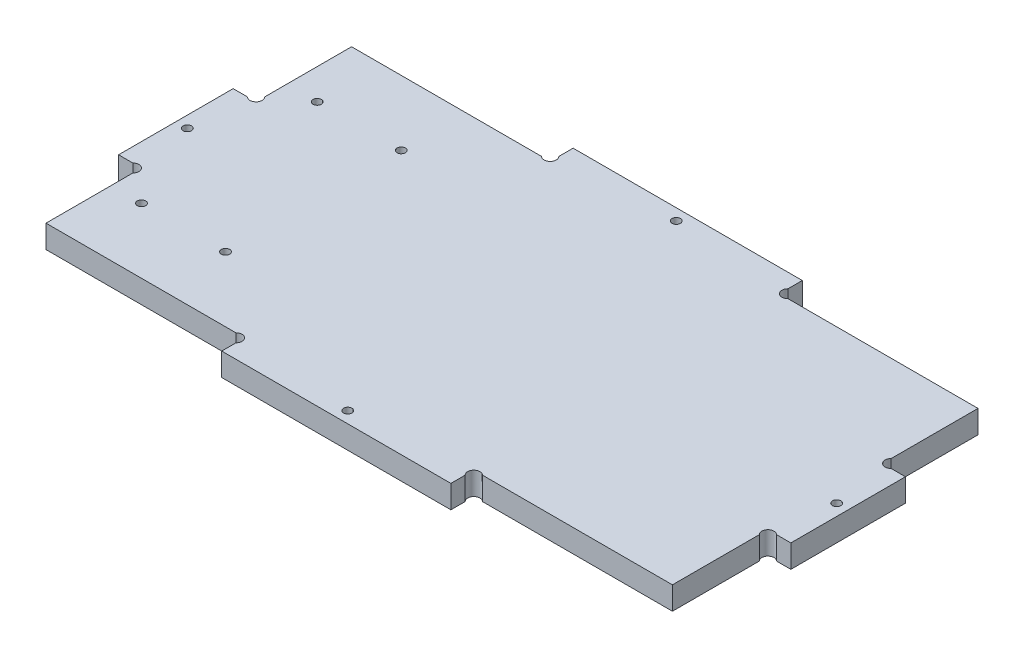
ISO-10303-21;
HEADER;
FILE_DESCRIPTION(('STEP AP214'),'2;1');
FILE_NAME('part.step','',(''),(''),'','','');
FILE_SCHEMA(('AUTOMOTIVE_DESIGN { 1 0 10303 214 1 1 1 1 }'));
ENDSEC;
DATA;
#1=APPLICATION_CONTEXT('core data for automotive mechanical design processes');
#2=APPLICATION_PROTOCOL_DEFINITION('international standard','automotive_design',2000,#1);
#3=PRODUCT_CONTEXT('',#1,'mechanical');
#4=PRODUCT('Part','Part','',(#3));
#5=PRODUCT_RELATED_PRODUCT_CATEGORY('part','',(#4));
#6=PRODUCT_DEFINITION_FORMATION('','',#4);
#7=PRODUCT_DEFINITION_CONTEXT('part definition',#1,'design');
#8=PRODUCT_DEFINITION('design','',#6,#7);
#9=PRODUCT_DEFINITION_SHAPE('','',#8);
#10=(LENGTH_UNIT() NAMED_UNIT(*) SI_UNIT(.MILLI.,.METRE.));
#11=(NAMED_UNIT(*) PLANE_ANGLE_UNIT() SI_UNIT($,.RADIAN.));
#12=(NAMED_UNIT(*) SI_UNIT($,.STERADIAN.) SOLID_ANGLE_UNIT());
#13=UNCERTAINTY_MEASURE_WITH_UNIT(LENGTH_MEASURE(1.E-05),#10,'distance_accuracy_value','');
#14=(GEOMETRIC_REPRESENTATION_CONTEXT(3) GLOBAL_UNCERTAINTY_ASSIGNED_CONTEXT((#13)) GLOBAL_UNIT_ASSIGNED_CONTEXT((#10,
#11,#12)) REPRESENTATION_CONTEXT('',''));
#15=CARTESIAN_POINT('',(0.,0.,0.));
#16=DIRECTION('',(0.,0.,1.));
#17=DIRECTION('',(1.,0.,0.));
#18=AXIS2_PLACEMENT_3D('',#15,#16,#17);
#19=CARTESIAN_POINT('',(56.8686291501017,6.,-147.131370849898));
#20=DIRECTION('',(0.,1.,0.));
#21=DIRECTION('',(0.,0.,1.));
#22=AXIS2_PLACEMENT_3D('',#19,#20,#21);
#23=PLANE('',#22);
#24=CARTESIAN_POINT('',(36.,6.,-129.));
#25=DIRECTION('',(0.,1.,0.));
#26=DIRECTION('',(0.,0.,1.));
#27=AXIS2_PLACEMENT_3D('',#24,#25,#26);
#28=CIRCLE('',#27,1.1);
#29=CARTESIAN_POINT('',(36.,6.,-127.9));
#30=VERTEX_POINT('',#29);
#31=EDGE_CURVE('E515',#30,#30,#28,.T.);
#32=ORIENTED_EDGE('',*,*,#31,.F.);
#33=EDGE_LOOP('',(#32));
#34=FACE_BOUND('',#33,.T.);
#35=CARTESIAN_POINT('',(14.,6.,-83.));
#36=DIRECTION('',(0.,1.,0.));
#37=DIRECTION('',(0.,0.,1.));
#38=AXIS2_PLACEMENT_3D('',#35,#36,#37);
#39=CIRCLE('',#38,1.1);
#40=CARTESIAN_POINT('',(14.,6.,-81.9));
#41=VERTEX_POINT('',#40);
#42=EDGE_CURVE('E527',#41,#41,#39,.T.);
#43=ORIENTED_EDGE('',*,*,#42,.F.);
#44=EDGE_LOOP('',(#43));
#45=FACE_BOUND('',#44,.T.);
#46=CARTESIAN_POINT('',(3.,6.,-106.));
#47=DIRECTION('',(0.,1.,0.));
#48=DIRECTION('',(0.,0.,1.));
#49=AXIS2_PLACEMENT_3D('',#46,#47,#48);
#50=CIRCLE('',#49,1.1);
#51=CARTESIAN_POINT('',(3.,6.,-104.9));
#52=VERTEX_POINT('',#51);
#53=EDGE_CURVE('E539',#52,#52,#50,.T.);
#54=ORIENTED_EDGE('',*,*,#53,.F.);
#55=EDGE_LOOP('',(#54));
#56=FACE_BOUND('',#55,.T.);
#57=CARTESIAN_POINT('',(88.,6.,-149.));
#58=DIRECTION('',(0.,1.,0.));
#59=DIRECTION('',(0.,0.,1.));
#60=AXIS2_PLACEMENT_3D('',#57,#58,#59);
#61=CIRCLE('',#60,1.1);
#62=CARTESIAN_POINT('',(88.,6.,-147.9));
#63=VERTEX_POINT('',#62);
#64=EDGE_CURVE('E254',#63,#63,#61,.T.);
#65=ORIENTED_EDGE('',*,*,#64,.F.);
#66=EDGE_LOOP('',(#65));
#67=FACE_BOUND('',#66,.T.);
#68=CARTESIAN_POINT('',(56.8686291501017,6.,-147.131370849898));
#69=DIRECTION('',(0.,-1.,0.));
#70=DIRECTION('',(0.,0.,1.));
#71=AXIS2_PLACEMENT_3D('',#68,#69,#70);
#72=CIRCLE('',#71,1.59999999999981);
#73=CARTESIAN_POINT('',(58.,6.,-148.262741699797));
#74=VERTEX_POINT('',#73);
#75=CARTESIAN_POINT('',(55.7372583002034,6.,-146.));
#76=VERTEX_POINT('',#75);
#77=EDGE_CURVE('E305',#74,#76,#72,.T.);
#78=ORIENTED_EDGE('',*,*,#77,.T.);
#79=DIRECTION('',(-1.,0.,0.));
#80=VECTOR('',#79,1.);
#81=CARTESIAN_POINT('',(6.,6.,-146.));
#82=LINE('',#81,#80);
#83=CARTESIAN_POINT('',(6.,6.,-146.));
#84=VERTEX_POINT('',#83);
#85=EDGE_CURVE('E153',#76,#84,#82,.T.);
#86=ORIENTED_EDGE('',*,*,#85,.T.);
#87=DIRECTION('',(0.,0.,1.));
#88=VECTOR('',#87,1.);
#89=CARTESIAN_POINT('',(6.,6.,-123.262741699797));
#90=LINE('',#89,#88);
#91=CARTESIAN_POINT('',(6.,6.,-123.262741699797));
#92=VERTEX_POINT('',#91);
#93=EDGE_CURVE('E380',#84,#92,#90,.T.);
#94=ORIENTED_EDGE('',*,*,#93,.T.);
#95=CARTESIAN_POINT('',(4.86862915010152,6.,-122.131370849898));
#96=DIRECTION('',(0.,-1.,0.));
#97=DIRECTION('',(0.,0.,1.));
#98=AXIS2_PLACEMENT_3D('',#95,#96,#97);
#99=CIRCLE('',#98,1.59999999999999);
#100=CARTESIAN_POINT('',(3.73725830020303,6.,-121.));
#101=VERTEX_POINT('',#100);
#102=EDGE_CURVE('E399',#92,#101,#99,.T.);
#103=ORIENTED_EDGE('',*,*,#102,.T.);
#104=DIRECTION('',(-1.,0.,0.));
#105=VECTOR('',#104,1.);
#106=CARTESIAN_POINT('',(3.73725830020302,6.,-121.));
#107=LINE('',#106,#105);
#108=CARTESIAN_POINT('',(0.,6.,-121.));
#109=VERTEX_POINT('',#108);
#110=EDGE_CURVE('E396',#101,#109,#107,.T.);
#111=ORIENTED_EDGE('',*,*,#110,.T.);
#112=DIRECTION('',(0.,0.,1.));
#113=VECTOR('',#112,1.);
#114=CARTESIAN_POINT('',(0.,6.,-121.));
#115=LINE('',#114,#113);
#116=CARTESIAN_POINT('',(0.,6.,-91.));
#117=VERTEX_POINT('',#116);
#118=EDGE_CURVE('E398',#109,#117,#115,.T.);
#119=ORIENTED_EDGE('',*,*,#118,.T.);
#120=DIRECTION('',(1.,0.,0.));
#121=VECTOR('',#120,1.);
#122=CARTESIAN_POINT('',(3.73725830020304,6.,-91.));
#123=LINE('',#122,#121);
#124=CARTESIAN_POINT('',(3.73725830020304,6.,-91.));
#125=VERTEX_POINT('',#124);
#126=EDGE_CURVE('E401',#117,#125,#123,.T.);
#127=ORIENTED_EDGE('',*,*,#126,.T.);
#128=CARTESIAN_POINT('',(4.86862915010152,6.,-89.8686291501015));
#129=DIRECTION('',(0.,-1.,0.));
#130=DIRECTION('',(0.,0.,-1.));
#131=AXIS2_PLACEMENT_3D('',#128,#129,#130);
#132=CIRCLE('',#131,1.59999999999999);
#133=CARTESIAN_POINT('',(6.,6.,-88.7372583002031));
#134=VERTEX_POINT('',#133);
#135=EDGE_CURVE('E407',#125,#134,#132,.T.);
#136=ORIENTED_EDGE('',*,*,#135,.T.);
#137=DIRECTION('',(0.,0.,1.));
#138=VECTOR('',#137,1.);
#139=CARTESIAN_POINT('',(6.,6.,-88.7372583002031));
#140=LINE('',#139,#138);
#141=CARTESIAN_POINT('',(6.,6.,-65.9999999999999));
#142=VERTEX_POINT('',#141);
#143=EDGE_CURVE('E409',#134,#142,#140,.T.);
#144=ORIENTED_EDGE('',*,*,#143,.T.);
#145=DIRECTION('',(1.,0.,0.));
#146=VECTOR('',#145,1.);
#147=CARTESIAN_POINT('',(6.,6.,-65.9999999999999));
#148=LINE('',#147,#146);
#149=CARTESIAN_POINT('',(55.7372583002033,6.,-66.0000000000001));
#150=VERTEX_POINT('',#149);
#151=EDGE_CURVE('E411',#142,#150,#148,.T.);
#152=ORIENTED_EDGE('',*,*,#151,.T.);
#153=CARTESIAN_POINT('',(56.8686291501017,6.,-64.8686291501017));
#154=DIRECTION('',(0.,-1.,0.));
#155=DIRECTION('',(0.,0.,-1.));
#156=AXIS2_PLACEMENT_3D('',#153,#154,#155);
#157=CIRCLE('',#156,1.59999999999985);
#158=CARTESIAN_POINT('',(58.,6.,-63.7372583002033));
#159=VERTEX_POINT('',#158);
#160=EDGE_CURVE('E413',#150,#159,#157,.T.);
#161=ORIENTED_EDGE('',*,*,#160,.T.);
#162=DIRECTION('',(0.,0.,1.));
#163=VECTOR('',#162,1.);
#164=CARTESIAN_POINT('',(58.,6.,-63.7372583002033));
#165=LINE('',#164,#163);
#166=CARTESIAN_POINT('',(58.,6.,-60.));
#167=VERTEX_POINT('',#166);
#168=EDGE_CURVE('E415',#159,#167,#165,.T.);
#169=ORIENTED_EDGE('',*,*,#168,.T.);
#170=DIRECTION('',(1.,0.,0.));
#171=VECTOR('',#170,1.);
#172=CARTESIAN_POINT('',(58.,6.,-60.));
#173=LINE('',#172,#171);
#174=CARTESIAN_POINT('',(118.,6.,-60.));
#175=VERTEX_POINT('',#174);
#176=EDGE_CURVE('E417',#167,#175,#173,.T.);
#177=ORIENTED_EDGE('',*,*,#176,.T.);
#178=DIRECTION('',(0.,0.,-1.));
#179=VECTOR('',#178,1.);
#180=CARTESIAN_POINT('',(118.,6.,-60.));
#181=LINE('',#180,#179);
#182=CARTESIAN_POINT('',(118.,6.,-63.7372583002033));
#183=VERTEX_POINT('',#182);
#184=EDGE_CURVE('E419',#175,#183,#181,.T.);
#185=ORIENTED_EDGE('',*,*,#184,.T.);
#186=CARTESIAN_POINT('',(119.131370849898,6.,-64.8686291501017));
#187=DIRECTION('',(0.,-1.,0.));
#188=DIRECTION('',(0.,0.,1.));
#189=AXIS2_PLACEMENT_3D('',#186,#187,#188);
#190=CIRCLE('',#189,1.59999999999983);
#191=CARTESIAN_POINT('',(120.262741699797,6.,-66.0000000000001));
#192=VERTEX_POINT('',#191);
#193=EDGE_CURVE('E421',#183,#192,#190,.T.);
#194=ORIENTED_EDGE('',*,*,#193,.T.);
#195=DIRECTION('',(1.,0.,0.));
#196=VECTOR('',#195,1.);
#197=CARTESIAN_POINT('',(120.262741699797,6.,-66.0000000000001));
#198=LINE('',#197,#196);
#199=CARTESIAN_POINT('',(170.,6.,-66.));
#200=VERTEX_POINT('',#199);
#201=EDGE_CURVE('E423',#192,#200,#198,.T.);
#202=ORIENTED_EDGE('',*,*,#201,.T.);
#203=DIRECTION('',(0.,0.,-1.));
#204=VECTOR('',#203,1.);
#205=CARTESIAN_POINT('',(170.,6.,-88.7372583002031));
#206=LINE('',#205,#204);
#207=CARTESIAN_POINT('',(170.,6.,-88.7372583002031));
#208=VERTEX_POINT('',#207);
#209=EDGE_CURVE('E425',#200,#208,#206,.T.);
#210=ORIENTED_EDGE('',*,*,#209,.T.);
#211=CARTESIAN_POINT('',(171.131370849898,6.,-89.8686291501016));
#212=DIRECTION('',(0.,-1.,0.));
#213=DIRECTION('',(0.,0.,1.));
#214=AXIS2_PLACEMENT_3D('',#211,#212,#213);
#215=CIRCLE('',#214,1.59999999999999);
#216=CARTESIAN_POINT('',(172.262741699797,6.,-91.));
#217=VERTEX_POINT('',#216);
#218=EDGE_CURVE('E427',#208,#217,#215,.T.);
#219=ORIENTED_EDGE('',*,*,#218,.T.);
#220=DIRECTION('',(1.,0.,0.));
#221=VECTOR('',#220,1.);
#222=CARTESIAN_POINT('',(172.262741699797,6.,-91.));
#223=LINE('',#222,#221);
#224=CARTESIAN_POINT('',(176.,6.,-91.));
#225=VERTEX_POINT('',#224);
#226=EDGE_CURVE('E429',#217,#225,#223,.T.);
#227=ORIENTED_EDGE('',*,*,#226,.T.);
#228=DIRECTION('',(0.,0.,-1.));
#229=VECTOR('',#228,1.);
#230=CARTESIAN_POINT('',(176.,6.,-121.));
#231=LINE('',#230,#229);
#232=CARTESIAN_POINT('',(176.,6.,-121.));
#233=VERTEX_POINT('',#232);
#234=EDGE_CURVE('E431',#225,#233,#231,.T.);
#235=ORIENTED_EDGE('',*,*,#234,.T.);
#236=DIRECTION('',(-1.,0.,0.));
#237=VECTOR('',#236,1.);
#238=CARTESIAN_POINT('',(172.262741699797,6.,-121.));
#239=LINE('',#238,#237);
#240=CARTESIAN_POINT('',(172.262741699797,6.,-121.));
#241=VERTEX_POINT('',#240);
#242=EDGE_CURVE('E433',#233,#241,#239,.T.);
#243=ORIENTED_EDGE('',*,*,#242,.T.);
#244=CARTESIAN_POINT('',(171.131370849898,6.,-122.131370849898));
#245=DIRECTION('',(0.,-1.,0.));
#246=DIRECTION('',(0.,0.,-1.));
#247=AXIS2_PLACEMENT_3D('',#244,#245,#246);
#248=CIRCLE('',#247,1.59999999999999);
#249=CARTESIAN_POINT('',(170.,6.,-123.262741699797));
#250=VERTEX_POINT('',#249);
#251=EDGE_CURVE('E435',#241,#250,#248,.T.);
#252=ORIENTED_EDGE('',*,*,#251,.T.);
#253=DIRECTION('',(0.,0.,-1.));
#254=VECTOR('',#253,1.);
#255=CARTESIAN_POINT('',(170.,6.,-123.262741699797));
#256=LINE('',#255,#254);
#257=CARTESIAN_POINT('',(170.,6.,-146.));
#258=VERTEX_POINT('',#257);
#259=EDGE_CURVE('E437',#250,#258,#256,.T.);
#260=ORIENTED_EDGE('',*,*,#259,.T.);
#261=DIRECTION('',(-1.,0.,0.));
#262=VECTOR('',#261,1.);
#263=CARTESIAN_POINT('',(120.262741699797,6.,-146.));
#264=LINE('',#263,#262);
#265=CARTESIAN_POINT('',(120.262741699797,6.,-146.));
#266=VERTEX_POINT('',#265);
#267=EDGE_CURVE('E439',#258,#266,#264,.T.);
#268=ORIENTED_EDGE('',*,*,#267,.T.);
#269=CARTESIAN_POINT('',(119.131370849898,6.,-147.131370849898));
#270=DIRECTION('',(0.,-1.,0.));
#271=DIRECTION('',(0.,0.,-1.));
#272=AXIS2_PLACEMENT_3D('',#269,#270,#271);
#273=CIRCLE('',#272,1.59999999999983);
#274=CARTESIAN_POINT('',(118.,6.,-148.262741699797));
#275=VERTEX_POINT('',#274);
#276=EDGE_CURVE('E232',#266,#275,#273,.T.);
#277=ORIENTED_EDGE('',*,*,#276,.T.);
#278=DIRECTION('',(0.,0.,-1.));
#279=VECTOR('',#278,1.);
#280=CARTESIAN_POINT('',(118.,6.,-152.));
#281=LINE('',#280,#279);
#282=CARTESIAN_POINT('',(118.,6.,-152.));
#283=VERTEX_POINT('',#282);
#284=EDGE_CURVE('E226',#275,#283,#281,.T.);
#285=ORIENTED_EDGE('',*,*,#284,.T.);
#286=DIRECTION('',(-1.,0.,0.));
#287=VECTOR('',#286,1.);
#288=CARTESIAN_POINT('',(58.,6.,-152.));
#289=LINE('',#288,#287);
#290=CARTESIAN_POINT('',(58.,6.,-152.));
#291=VERTEX_POINT('',#290);
#292=EDGE_CURVE('E230',#283,#291,#289,.T.);
#293=ORIENTED_EDGE('',*,*,#292,.T.);
#294=DIRECTION('',(0.,0.,1.));
#295=VECTOR('',#294,1.);
#296=CARTESIAN_POINT('',(58.,6.,-148.262741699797));
#297=LINE('',#296,#295);
#298=EDGE_CURVE('E50',#291,#74,#297,.T.);
#299=ORIENTED_EDGE('',*,*,#298,.T.);
#300=EDGE_LOOP('',(#78,#86,#94,#103,#111,#119,#127,#136,#144,#152,#161,#169,#177,#185,#194,#202,
#210,#219,#227,#235,#243,#252,#260,#268,#277,#285,#293,#299));
#301=FACE_BOUND('',#300,.T.);
#302=CARTESIAN_POINT('',(88.,6.,-63.));
#303=DIRECTION('',(0.,1.,0.));
#304=DIRECTION('',(0.,0.,-1.));
#305=AXIS2_PLACEMENT_3D('',#302,#303,#304);
#306=CIRCLE('',#305,1.1);
#307=CARTESIAN_POINT('',(88.,6.,-64.1));
#308=VERTEX_POINT('',#307);
#309=EDGE_CURVE('E545',#308,#308,#306,.T.);
#310=ORIENTED_EDGE('',*,*,#309,.F.);
#311=EDGE_LOOP('',(#310));
#312=FACE_BOUND('',#311,.T.);
#313=CARTESIAN_POINT('',(173.,6.,-106.));
#314=DIRECTION('',(0.,1.,0.));
#315=DIRECTION('',(0.,0.,-1.));
#316=AXIS2_PLACEMENT_3D('',#313,#314,#315);
#317=CIRCLE('',#316,1.09999999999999);
#318=CARTESIAN_POINT('',(173.,6.,-107.1));
#319=VERTEX_POINT('',#318);
#320=EDGE_CURVE('E533',#319,#319,#317,.T.);
#321=ORIENTED_EDGE('',*,*,#320,.F.);
#322=EDGE_LOOP('',(#321));
#323=FACE_BOUND('',#322,.T.);
#324=CARTESIAN_POINT('',(14.,6.,-129.));
#325=DIRECTION('',(0.,1.,0.));
#326=DIRECTION('',(0.,0.,-1.));
#327=AXIS2_PLACEMENT_3D('',#324,#325,#326);
#328=CIRCLE('',#327,1.1);
#329=CARTESIAN_POINT('',(14.,6.,-130.1));
#330=VERTEX_POINT('',#329);
#331=EDGE_CURVE('E521',#330,#330,#328,.T.);
#332=ORIENTED_EDGE('',*,*,#331,.F.);
#333=EDGE_LOOP('',(#332));
#334=FACE_BOUND('',#333,.T.);
#335=CARTESIAN_POINT('',(36.,6.,-83.));
#336=DIRECTION('',(0.,1.,0.));
#337=DIRECTION('',(0.,0.,-1.));
#338=AXIS2_PLACEMENT_3D('',#335,#336,#337);
#339=CIRCLE('',#338,1.10000000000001);
#340=CARTESIAN_POINT('',(36.,6.,-84.1));
#341=VERTEX_POINT('',#340);
#342=EDGE_CURVE('E506',#341,#341,#339,.T.);
#343=ORIENTED_EDGE('',*,*,#342,.F.);
#344=EDGE_LOOP('',(#343));
#345=FACE_BOUND('',#344,.T.);
#346=ADVANCED_FACE('F33',(#34,#45,#56,#67,#301,#312,#323,#334,#345),#23,.T.);
#347=CARTESIAN_POINT('',(56.8686291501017,0.,-147.131370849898));
#348=DIRECTION('',(0.,1.,0.));
#349=DIRECTION('',(0.,0.,1.));
#350=AXIS2_PLACEMENT_3D('',#347,#348,#349);
#351=PLANE('',#350);
#352=CARTESIAN_POINT('',(56.8686291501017,0.,-147.131370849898));
#353=DIRECTION('',(0.,-1.,0.));
#354=DIRECTION('',(0.,0.,1.));
#355=AXIS2_PLACEMENT_3D('',#352,#353,#354);
#356=CIRCLE('',#355,1.59999999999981);
#357=CARTESIAN_POINT('',(58.,0.,-148.262741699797));
#358=VERTEX_POINT('',#357);
#359=CARTESIAN_POINT('',(55.7372583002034,0.,-146.));
#360=VERTEX_POINT('',#359);
#361=EDGE_CURVE('E250',#358,#360,#356,.T.);
#362=ORIENTED_EDGE('',*,*,#361,.F.);
#363=DIRECTION('',(0.,0.,1.));
#364=VECTOR('',#363,1.);
#365=CARTESIAN_POINT('',(58.,0.,-148.262741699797));
#366=LINE('',#365,#364);
#367=CARTESIAN_POINT('',(58.,0.,-152.));
#368=VERTEX_POINT('',#367);
#369=EDGE_CURVE('E145',#368,#358,#366,.T.);
#370=ORIENTED_EDGE('',*,*,#369,.F.);
#371=DIRECTION('',(-1.,0.,0.));
#372=VECTOR('',#371,1.);
#373=CARTESIAN_POINT('',(58.,0.,-152.));
#374=LINE('',#373,#372);
#375=CARTESIAN_POINT('',(118.,0.,-152.));
#376=VERTEX_POINT('',#375);
#377=EDGE_CURVE('E139',#376,#368,#374,.T.);
#378=ORIENTED_EDGE('',*,*,#377,.F.);
#379=DIRECTION('',(0.,0.,-1.));
#380=VECTOR('',#379,1.);
#381=CARTESIAN_POINT('',(118.,0.,-152.));
#382=LINE('',#381,#380);
#383=CARTESIAN_POINT('',(118.,0.,-148.262741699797));
#384=VERTEX_POINT('',#383);
#385=EDGE_CURVE('E240',#384,#376,#382,.T.);
#386=ORIENTED_EDGE('',*,*,#385,.F.);
#387=CARTESIAN_POINT('',(119.131370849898,0.,-147.131370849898));
#388=DIRECTION('',(0.,-1.,0.));
#389=DIRECTION('',(0.,0.,-1.));
#390=AXIS2_PLACEMENT_3D('',#387,#388,#389);
#391=CIRCLE('',#390,1.59999999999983);
#392=CARTESIAN_POINT('',(120.262741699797,0.,-146.));
#393=VERTEX_POINT('',#392);
#394=EDGE_CURVE('E300',#393,#384,#391,.T.);
#395=ORIENTED_EDGE('',*,*,#394,.F.);
#396=DIRECTION('',(-1.,0.,0.));
#397=VECTOR('',#396,1.);
#398=CARTESIAN_POINT('',(120.262741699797,0.,-146.));
#399=LINE('',#398,#397);
#400=CARTESIAN_POINT('',(170.,0.,-146.));
#401=VERTEX_POINT('',#400);
#402=EDGE_CURVE('E298',#401,#393,#399,.T.);
#403=ORIENTED_EDGE('',*,*,#402,.F.);
#404=DIRECTION('',(0.,0.,-1.));
#405=VECTOR('',#404,1.);
#406=CARTESIAN_POINT('',(170.,0.,-123.262741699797));
#407=LINE('',#406,#405);
#408=CARTESIAN_POINT('',(170.,0.,-123.262741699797));
#409=VERTEX_POINT('',#408);
#410=EDGE_CURVE('E296',#409,#401,#407,.T.);
#411=ORIENTED_EDGE('',*,*,#410,.F.);
#412=CARTESIAN_POINT('',(171.131370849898,0.,-122.131370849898));
#413=DIRECTION('',(0.,-1.,0.));
#414=DIRECTION('',(0.,0.,-1.));
#415=AXIS2_PLACEMENT_3D('',#412,#413,#414);
#416=CIRCLE('',#415,1.59999999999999);
#417=CARTESIAN_POINT('',(172.262741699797,0.,-121.));
#418=VERTEX_POINT('',#417);
#419=EDGE_CURVE('E294',#418,#409,#416,.T.);
#420=ORIENTED_EDGE('',*,*,#419,.F.);
#421=DIRECTION('',(-1.,0.,0.));
#422=VECTOR('',#421,1.);
#423=CARTESIAN_POINT('',(172.262741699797,0.,-121.));
#424=LINE('',#423,#422);
#425=CARTESIAN_POINT('',(176.,0.,-121.));
#426=VERTEX_POINT('',#425);
#427=EDGE_CURVE('E292',#426,#418,#424,.T.);
#428=ORIENTED_EDGE('',*,*,#427,.F.);
#429=DIRECTION('',(0.,0.,-1.));
#430=VECTOR('',#429,1.);
#431=CARTESIAN_POINT('',(176.,0.,-121.));
#432=LINE('',#431,#430);
#433=CARTESIAN_POINT('',(176.,0.,-91.));
#434=VERTEX_POINT('',#433);
#435=EDGE_CURVE('E290',#434,#426,#432,.T.);
#436=ORIENTED_EDGE('',*,*,#435,.F.);
#437=DIRECTION('',(1.,0.,0.));
#438=VECTOR('',#437,1.);
#439=CARTESIAN_POINT('',(172.262741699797,0.,-91.));
#440=LINE('',#439,#438);
#441=CARTESIAN_POINT('',(172.262741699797,0.,-91.));
#442=VERTEX_POINT('',#441);
#443=EDGE_CURVE('E288',#442,#434,#440,.T.);
#444=ORIENTED_EDGE('',*,*,#443,.F.);
#445=CARTESIAN_POINT('',(171.131370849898,0.,-89.8686291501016));
#446=DIRECTION('',(0.,-1.,0.));
#447=DIRECTION('',(0.,0.,1.));
#448=AXIS2_PLACEMENT_3D('',#445,#446,#447);
#449=CIRCLE('',#448,1.59999999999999);
#450=CARTESIAN_POINT('',(170.,0.,-88.7372583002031));
#451=VERTEX_POINT('',#450);
#452=EDGE_CURVE('E286',#451,#442,#449,.T.);
#453=ORIENTED_EDGE('',*,*,#452,.F.);
#454=DIRECTION('',(0.,0.,-1.));
#455=VECTOR('',#454,1.);
#456=CARTESIAN_POINT('',(170.,0.,-88.7372583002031));
#457=LINE('',#456,#455);
#458=CARTESIAN_POINT('',(170.,0.,-66.));
#459=VERTEX_POINT('',#458);
#460=EDGE_CURVE('E284',#459,#451,#457,.T.);
#461=ORIENTED_EDGE('',*,*,#460,.F.);
#462=DIRECTION('',(1.,0.,0.));
#463=VECTOR('',#462,1.);
#464=CARTESIAN_POINT('',(120.262741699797,0.,-66.0000000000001));
#465=LINE('',#464,#463);
#466=CARTESIAN_POINT('',(120.262741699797,0.,-66.0000000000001));
#467=VERTEX_POINT('',#466);
#468=EDGE_CURVE('E282',#467,#459,#465,.T.);
#469=ORIENTED_EDGE('',*,*,#468,.F.);
#470=CARTESIAN_POINT('',(119.131370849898,0.,-64.8686291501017));
#471=DIRECTION('',(0.,-1.,0.));
#472=DIRECTION('',(0.,0.,1.));
#473=AXIS2_PLACEMENT_3D('',#470,#471,#472);
#474=CIRCLE('',#473,1.59999999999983);
#475=CARTESIAN_POINT('',(118.,0.,-63.7372583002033));
#476=VERTEX_POINT('',#475);
#477=EDGE_CURVE('E280',#476,#467,#474,.T.);
#478=ORIENTED_EDGE('',*,*,#477,.F.);
#479=DIRECTION('',(0.,0.,-1.));
#480=VECTOR('',#479,1.);
#481=CARTESIAN_POINT('',(118.,0.,-60.));
#482=LINE('',#481,#480);
#483=CARTESIAN_POINT('',(118.,0.,-60.));
#484=VERTEX_POINT('',#483);
#485=EDGE_CURVE('E278',#484,#476,#482,.T.);
#486=ORIENTED_EDGE('',*,*,#485,.F.);
#487=DIRECTION('',(1.,0.,0.));
#488=VECTOR('',#487,1.);
#489=CARTESIAN_POINT('',(58.,0.,-60.));
#490=LINE('',#489,#488);
#491=CARTESIAN_POINT('',(58.,0.,-60.));
#492=VERTEX_POINT('',#491);
#493=EDGE_CURVE('E276',#492,#484,#490,.T.);
#494=ORIENTED_EDGE('',*,*,#493,.F.);
#495=DIRECTION('',(0.,0.,1.));
#496=VECTOR('',#495,1.);
#497=CARTESIAN_POINT('',(58.,0.,-63.7372583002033));
#498=LINE('',#497,#496);
#499=CARTESIAN_POINT('',(58.,0.,-63.7372583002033));
#500=VERTEX_POINT('',#499);
#501=EDGE_CURVE('E274',#500,#492,#498,.T.);
#502=ORIENTED_EDGE('',*,*,#501,.F.);
#503=CARTESIAN_POINT('',(56.8686291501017,0.,-64.8686291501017));
#504=DIRECTION('',(0.,-1.,0.));
#505=DIRECTION('',(0.,0.,-1.));
#506=AXIS2_PLACEMENT_3D('',#503,#504,#505);
#507=CIRCLE('',#506,1.59999999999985);
#508=CARTESIAN_POINT('',(55.7372583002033,0.,-66.0000000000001));
#509=VERTEX_POINT('',#508);
#510=EDGE_CURVE('E272',#509,#500,#507,.T.);
#511=ORIENTED_EDGE('',*,*,#510,.F.);
#512=DIRECTION('',(1.,0.,0.));
#513=VECTOR('',#512,1.);
#514=CARTESIAN_POINT('',(6.,0.,-65.9999999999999));
#515=LINE('',#514,#513);
#516=CARTESIAN_POINT('',(6.,0.,-65.9999999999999));
#517=VERTEX_POINT('',#516);
#518=EDGE_CURVE('E270',#517,#509,#515,.T.);
#519=ORIENTED_EDGE('',*,*,#518,.F.);
#520=DIRECTION('',(0.,0.,1.));
#521=VECTOR('',#520,1.);
#522=CARTESIAN_POINT('',(6.,0.,-88.7372583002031));
#523=LINE('',#522,#521);
#524=CARTESIAN_POINT('',(6.,0.,-88.7372583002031));
#525=VERTEX_POINT('',#524);
#526=EDGE_CURVE('E268',#525,#517,#523,.T.);
#527=ORIENTED_EDGE('',*,*,#526,.F.);
#528=CARTESIAN_POINT('',(4.86862915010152,0.,-89.8686291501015));
#529=DIRECTION('',(0.,-1.,0.));
#530=DIRECTION('',(0.,0.,-1.));
#531=AXIS2_PLACEMENT_3D('',#528,#529,#530);
#532=CIRCLE('',#531,1.59999999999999);
#533=CARTESIAN_POINT('',(3.73725830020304,0.,-91.));
#534=VERTEX_POINT('',#533);
#535=EDGE_CURVE('E266',#534,#525,#532,.T.);
#536=ORIENTED_EDGE('',*,*,#535,.F.);
#537=DIRECTION('',(1.,0.,0.));
#538=VECTOR('',#537,1.);
#539=CARTESIAN_POINT('',(3.73725830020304,0.,-91.));
#540=LINE('',#539,#538);
#541=CARTESIAN_POINT('',(0.,0.,-91.));
#542=VERTEX_POINT('',#541);
#543=EDGE_CURVE('E264',#542,#534,#540,.T.);
#544=ORIENTED_EDGE('',*,*,#543,.F.);
#545=DIRECTION('',(0.,0.,1.));
#546=VECTOR('',#545,1.);
#547=CARTESIAN_POINT('',(0.,0.,-121.));
#548=LINE('',#547,#546);
#549=CARTESIAN_POINT('',(0.,0.,-121.));
#550=VERTEX_POINT('',#549);
#551=EDGE_CURVE('E262',#550,#542,#548,.T.);
#552=ORIENTED_EDGE('',*,*,#551,.F.);
#553=DIRECTION('',(-1.,0.,0.));
#554=VECTOR('',#553,1.);
#555=CARTESIAN_POINT('',(3.73725830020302,0.,-121.));
#556=LINE('',#555,#554);
#557=CARTESIAN_POINT('',(3.73725830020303,0.,-121.));
#558=VERTEX_POINT('',#557);
#559=EDGE_CURVE('E260',#558,#550,#556,.T.);
#560=ORIENTED_EDGE('',*,*,#559,.F.);
#561=CARTESIAN_POINT('',(4.86862915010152,0.,-122.131370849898));
#562=DIRECTION('',(0.,-1.,0.));
#563=DIRECTION('',(0.,0.,1.));
#564=AXIS2_PLACEMENT_3D('',#561,#562,#563);
#565=CIRCLE('',#564,1.59999999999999);
#566=CARTESIAN_POINT('',(6.,0.,-123.262741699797));
#567=VERTEX_POINT('',#566);
#568=EDGE_CURVE('E258',#567,#558,#565,.T.);
#569=ORIENTED_EDGE('',*,*,#568,.F.);
#570=DIRECTION('',(0.,0.,1.));
#571=VECTOR('',#570,1.);
#572=CARTESIAN_POINT('',(6.,0.,-123.262741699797));
#573=LINE('',#572,#571);
#574=CARTESIAN_POINT('',(6.,0.,-146.));
#575=VERTEX_POINT('',#574);
#576=EDGE_CURVE('E256',#575,#567,#573,.T.);
#577=ORIENTED_EDGE('',*,*,#576,.F.);
#578=DIRECTION('',(-1.,0.,0.));
#579=VECTOR('',#578,1.);
#580=CARTESIAN_POINT('',(6.,0.,-146.));
#581=LINE('',#580,#579);
#582=EDGE_CURVE('E253',#360,#575,#581,.T.);
#583=ORIENTED_EDGE('',*,*,#582,.F.);
#584=EDGE_LOOP('',(#362,#370,#378,#386,#395,#403,#411,#420,#428,#436,#444,#453,#461,#469,#478,
#486,#494,#502,#511,#519,#527,#536,#544,#552,#560,#569,#577,#583));
#585=FACE_BOUND('',#584,.T.);
#586=CARTESIAN_POINT('',(88.,0.,-149.));
#587=DIRECTION('',(0.,1.,0.));
#588=DIRECTION('',(0.,0.,1.));
#589=AXIS2_PLACEMENT_3D('',#586,#587,#588);
#590=CIRCLE('',#589,1.1);
#591=CARTESIAN_POINT('',(88.,0.,-147.9));
#592=VERTEX_POINT('',#591);
#593=EDGE_CURVE('E548',#592,#592,#590,.T.);
#594=ORIENTED_EDGE('',*,*,#593,.T.);
#595=EDGE_LOOP('',(#594));
#596=FACE_BOUND('',#595,.T.);
#597=CARTESIAN_POINT('',(88.,0.,-63.));
#598=DIRECTION('',(0.,1.,0.));
#599=DIRECTION('',(0.,0.,-1.));
#600=AXIS2_PLACEMENT_3D('',#597,#598,#599);
#601=CIRCLE('',#600,1.1);
#602=CARTESIAN_POINT('',(88.,0.,-64.1));
#603=VERTEX_POINT('',#602);
#604=EDGE_CURVE('E542',#603,#603,#601,.T.);
#605=ORIENTED_EDGE('',*,*,#604,.T.);
#606=EDGE_LOOP('',(#605));
#607=FACE_BOUND('',#606,.T.);
#608=CARTESIAN_POINT('',(3.,0.,-106.));
#609=DIRECTION('',(0.,1.,0.));
#610=DIRECTION('',(0.,0.,1.));
#611=AXIS2_PLACEMENT_3D('',#608,#609,#610);
#612=CIRCLE('',#611,1.1);
#613=CARTESIAN_POINT('',(3.,0.,-104.9));
#614=VERTEX_POINT('',#613);
#615=EDGE_CURVE('E536',#614,#614,#612,.T.);
#616=ORIENTED_EDGE('',*,*,#615,.T.);
#617=EDGE_LOOP('',(#616));
#618=FACE_BOUND('',#617,.T.);
#619=CARTESIAN_POINT('',(173.,0.,-106.));
#620=DIRECTION('',(0.,1.,0.));
#621=DIRECTION('',(0.,0.,-1.));
#622=AXIS2_PLACEMENT_3D('',#619,#620,#621);
#623=CIRCLE('',#622,1.09999999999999);
#624=CARTESIAN_POINT('',(173.,0.,-107.1));
#625=VERTEX_POINT('',#624);
#626=EDGE_CURVE('E530',#625,#625,#623,.T.);
#627=ORIENTED_EDGE('',*,*,#626,.T.);
#628=EDGE_LOOP('',(#627));
#629=FACE_BOUND('',#628,.T.);
#630=CARTESIAN_POINT('',(14.,0.,-83.));
#631=DIRECTION('',(0.,1.,0.));
#632=DIRECTION('',(0.,0.,1.));
#633=AXIS2_PLACEMENT_3D('',#630,#631,#632);
#634=CIRCLE('',#633,1.1);
#635=CARTESIAN_POINT('',(14.,0.,-81.9));
#636=VERTEX_POINT('',#635);
#637=EDGE_CURVE('E524',#636,#636,#634,.T.);
#638=ORIENTED_EDGE('',*,*,#637,.T.);
#639=EDGE_LOOP('',(#638));
#640=FACE_BOUND('',#639,.T.);
#641=CARTESIAN_POINT('',(14.,0.,-129.));
#642=DIRECTION('',(0.,1.,0.));
#643=DIRECTION('',(0.,0.,-1.));
#644=AXIS2_PLACEMENT_3D('',#641,#642,#643);
#645=CIRCLE('',#644,1.1);
#646=CARTESIAN_POINT('',(14.,0.,-130.1));
#647=VERTEX_POINT('',#646);
#648=EDGE_CURVE('E518',#647,#647,#645,.T.);
#649=ORIENTED_EDGE('',*,*,#648,.T.);
#650=EDGE_LOOP('',(#649));
#651=FACE_BOUND('',#650,.T.);
#652=CARTESIAN_POINT('',(36.,0.,-129.));
#653=DIRECTION('',(0.,1.,0.));
#654=DIRECTION('',(0.,0.,1.));
#655=AXIS2_PLACEMENT_3D('',#652,#653,#654);
#656=CIRCLE('',#655,1.1);
#657=CARTESIAN_POINT('',(36.,0.,-127.9));
#658=VERTEX_POINT('',#657);
#659=EDGE_CURVE('E512',#658,#658,#656,.T.);
#660=ORIENTED_EDGE('',*,*,#659,.T.);
#661=EDGE_LOOP('',(#660));
#662=FACE_BOUND('',#661,.T.);
#663=CARTESIAN_POINT('',(36.,0.,-83.));
#664=DIRECTION('',(0.,1.,0.));
#665=DIRECTION('',(0.,0.,-1.));
#666=AXIS2_PLACEMENT_3D('',#663,#664,#665);
#667=CIRCLE('',#666,1.10000000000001);
#668=CARTESIAN_POINT('',(36.,0.,-84.1));
#669=VERTEX_POINT('',#668);
#670=EDGE_CURVE('E509',#669,#669,#667,.T.);
#671=ORIENTED_EDGE('',*,*,#670,.T.);
#672=EDGE_LOOP('',(#671));
#673=FACE_BOUND('',#672,.T.);
#674=ADVANCED_FACE('F384',(#585,#596,#607,#618,#629,#640,#651,#662,#673),#351,.F.);
#675=CARTESIAN_POINT('',(56.8686291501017,6.,-147.131370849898));
#676=DIRECTION('',(0.,-1.,0.));
#677=DIRECTION('',(0.,0.,-1.));
#678=AXIS2_PLACEMENT_3D('',#675,#676,#677);
#679=CYLINDRICAL_SURFACE('',#678,1.59999999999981);
#680=ORIENTED_EDGE('',*,*,#361,.T.);
#681=DIRECTION('',(0.,-1.,0.));
#682=VECTOR('',#681,1.);
#683=CARTESIAN_POINT('',(55.7372583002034,6.,-146.));
#684=LINE('',#683,#682);
#685=EDGE_CURVE('E11',#76,#360,#684,.T.);
#686=ORIENTED_EDGE('',*,*,#685,.F.);
#687=ORIENTED_EDGE('',*,*,#77,.F.);
#688=DIRECTION('',(0.,-1.,0.));
#689=VECTOR('',#688,1.);
#690=CARTESIAN_POINT('',(58.,6.,-148.262741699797));
#691=LINE('',#690,#689);
#692=EDGE_CURVE('E246',#74,#358,#691,.T.);
#693=ORIENTED_EDGE('',*,*,#692,.T.);
#694=EDGE_LOOP('',(#680,#686,#687,#693));
#695=FACE_BOUND('',#694,.T.);
#696=ADVANCED_FACE('F35',(#695),#679,.F.);
#697=CARTESIAN_POINT('',(6.,6.,-146.));
#698=DIRECTION('',(0.,0.,1.));
#699=DIRECTION('',(1.,0.,0.));
#700=AXIS2_PLACEMENT_3D('',#697,#698,#699);
#701=PLANE('',#700);
#702=ORIENTED_EDGE('',*,*,#582,.T.);
#703=DIRECTION('',(0.,-1.,0.));
#704=VECTOR('',#703,1.);
#705=CARTESIAN_POINT('',(6.,6.,-146.));
#706=LINE('',#705,#704);
#707=EDGE_CURVE('E42',#84,#575,#706,.T.);
#708=ORIENTED_EDGE('',*,*,#707,.F.);
#709=ORIENTED_EDGE('',*,*,#85,.F.);
#710=ORIENTED_EDGE('',*,*,#685,.T.);
#711=EDGE_LOOP('',(#702,#708,#709,#710));
#712=FACE_BOUND('',#711,.T.);
#713=ADVANCED_FACE('F854',(#712),#701,.F.);
#714=CARTESIAN_POINT('',(6.,6.,-123.262741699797));
#715=DIRECTION('',(1.,0.,0.));
#716=DIRECTION('',(0.,0.,-1.));
#717=AXIS2_PLACEMENT_3D('',#714,#715,#716);
#718=PLANE('',#717);
#719=ORIENTED_EDGE('',*,*,#576,.T.);
#720=DIRECTION('',(0.,-1.,0.));
#721=VECTOR('',#720,1.);
#722=CARTESIAN_POINT('',(6.,6.,-123.262741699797));
#723=LINE('',#722,#721);
#724=EDGE_CURVE('E372',#92,#567,#723,.T.);
#725=ORIENTED_EDGE('',*,*,#724,.F.);
#726=ORIENTED_EDGE('',*,*,#93,.F.);
#727=ORIENTED_EDGE('',*,*,#707,.T.);
#728=EDGE_LOOP('',(#719,#725,#726,#727));
#729=FACE_BOUND('',#728,.T.);
#730=ADVANCED_FACE('F378',(#729),#718,.F.);
#731=CARTESIAN_POINT('',(4.86862915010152,6.,-122.131370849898));
#732=DIRECTION('',(0.,-1.,0.));
#733=DIRECTION('',(0.,0.,-1.));
#734=AXIS2_PLACEMENT_3D('',#731,#732,#733);
#735=CYLINDRICAL_SURFACE('',#734,1.59999999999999);
#736=ORIENTED_EDGE('',*,*,#568,.T.);
#737=DIRECTION('',(0.,-1.,0.));
#738=VECTOR('',#737,1.);
#739=CARTESIAN_POINT('',(3.73725830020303,6.,-121.));
#740=LINE('',#739,#738);
#741=EDGE_CURVE('E369',#101,#558,#740,.T.);
#742=ORIENTED_EDGE('',*,*,#741,.F.);
#743=ORIENTED_EDGE('',*,*,#102,.F.);
#744=ORIENTED_EDGE('',*,*,#724,.T.);
#745=EDGE_LOOP('',(#736,#742,#743,#744));
#746=FACE_BOUND('',#745,.T.);
#747=ADVANCED_FACE('F390',(#746),#735,.F.);
#748=CARTESIAN_POINT('',(3.73725830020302,6.,-121.));
#749=DIRECTION('',(0.,0.,1.));
#750=DIRECTION('',(1.,0.,0.));
#751=AXIS2_PLACEMENT_3D('',#748,#749,#750);
#752=PLANE('',#751);
#753=ORIENTED_EDGE('',*,*,#559,.T.);
#754=DIRECTION('',(0.,-1.,0.));
#755=VECTOR('',#754,1.);
#756=CARTESIAN_POINT('',(0.,6.,-121.));
#757=LINE('',#756,#755);
#758=EDGE_CURVE('E366',#109,#550,#757,.T.);
#759=ORIENTED_EDGE('',*,*,#758,.F.);
#760=ORIENTED_EDGE('',*,*,#110,.F.);
#761=ORIENTED_EDGE('',*,*,#741,.T.);
#762=EDGE_LOOP('',(#753,#759,#760,#761));
#763=FACE_BOUND('',#762,.T.);
#764=ADVANCED_FACE('F394',(#763),#752,.F.);
#765=CARTESIAN_POINT('',(0.,6.,-121.));
#766=DIRECTION('',(1.,0.,0.));
#767=DIRECTION('',(0.,0.,-1.));
#768=AXIS2_PLACEMENT_3D('',#765,#766,#767);
#769=PLANE('',#768);
#770=ORIENTED_EDGE('',*,*,#551,.T.);
#771=DIRECTION('',(0.,-1.,0.));
#772=VECTOR('',#771,1.);
#773=CARTESIAN_POINT('',(0.,6.,-91.));
#774=LINE('',#773,#772);
#775=EDGE_CURVE('E363',#117,#542,#774,.T.);
#776=ORIENTED_EDGE('',*,*,#775,.F.);
#777=ORIENTED_EDGE('',*,*,#118,.F.);
#778=ORIENTED_EDGE('',*,*,#758,.T.);
#779=EDGE_LOOP('',(#770,#776,#777,#778));
#780=FACE_BOUND('',#779,.T.);
#781=ADVANCED_FACE('F819',(#780),#769,.F.);
#782=CARTESIAN_POINT('',(3.73725830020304,6.,-91.));
#783=DIRECTION('',(0.,0.,-1.));
#784=DIRECTION('',(-1.,0.,0.));
#785=AXIS2_PLACEMENT_3D('',#782,#783,#784);
#786=PLANE('',#785);
#787=ORIENTED_EDGE('',*,*,#543,.T.);
#788=DIRECTION('',(0.,-1.,0.));
#789=VECTOR('',#788,1.);
#790=CARTESIAN_POINT('',(3.73725830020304,6.,-91.));
#791=LINE('',#790,#789);
#792=EDGE_CURVE('E360',#125,#534,#791,.T.);
#793=ORIENTED_EDGE('',*,*,#792,.F.);
#794=ORIENTED_EDGE('',*,*,#126,.F.);
#795=ORIENTED_EDGE('',*,*,#775,.T.);
#796=EDGE_LOOP('',(#787,#793,#794,#795));
#797=FACE_BOUND('',#796,.T.);
#798=ADVANCED_FACE('F809',(#797),#786,.F.);
#799=CARTESIAN_POINT('',(4.86862915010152,6.,-89.8686291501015));
#800=DIRECTION('',(0.,-1.,0.));
#801=DIRECTION('',(0.,0.,-1.));
#802=AXIS2_PLACEMENT_3D('',#799,#800,#801);
#803=CYLINDRICAL_SURFACE('',#802,1.59999999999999);
#804=ORIENTED_EDGE('',*,*,#535,.T.);
#805=DIRECTION('',(0.,-1.,0.));
#806=VECTOR('',#805,1.);
#807=CARTESIAN_POINT('',(6.,6.,-88.7372583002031));
#808=LINE('',#807,#806);
#809=EDGE_CURVE('E357',#134,#525,#808,.T.);
#810=ORIENTED_EDGE('',*,*,#809,.F.);
#811=ORIENTED_EDGE('',*,*,#135,.F.);
#812=ORIENTED_EDGE('',*,*,#792,.T.);
#813=EDGE_LOOP('',(#804,#810,#811,#812));
#814=FACE_BOUND('',#813,.T.);
#815=ADVANCED_FACE('F799',(#814),#803,.F.);
#816=CARTESIAN_POINT('',(6.,6.,-88.7372583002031));
#817=DIRECTION('',(1.,0.,0.));
#818=DIRECTION('',(0.,0.,-1.));
#819=AXIS2_PLACEMENT_3D('',#816,#817,#818);
#820=PLANE('',#819);
#821=ORIENTED_EDGE('',*,*,#526,.T.);
#822=DIRECTION('',(0.,-1.,0.));
#823=VECTOR('',#822,1.);
#824=CARTESIAN_POINT('',(6.,6.,-65.9999999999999));
#825=LINE('',#824,#823);
#826=EDGE_CURVE('E354',#142,#517,#825,.T.);
#827=ORIENTED_EDGE('',*,*,#826,.F.);
#828=ORIENTED_EDGE('',*,*,#143,.F.);
#829=ORIENTED_EDGE('',*,*,#809,.T.);
#830=EDGE_LOOP('',(#821,#827,#828,#829));
#831=FACE_BOUND('',#830,.T.);
#832=ADVANCED_FACE('F789',(#831),#820,.F.);
#833=CARTESIAN_POINT('',(6.,6.,-65.9999999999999));
#834=DIRECTION('',(0.,0.,-1.));
#835=DIRECTION('',(-1.,0.,0.));
#836=AXIS2_PLACEMENT_3D('',#833,#834,#835);
#837=PLANE('',#836);
#838=ORIENTED_EDGE('',*,*,#518,.T.);
#839=DIRECTION('',(0.,-1.,0.));
#840=VECTOR('',#839,1.);
#841=CARTESIAN_POINT('',(55.7372583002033,6.,-66.0000000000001));
#842=LINE('',#841,#840);
#843=EDGE_CURVE('E351',#150,#509,#842,.T.);
#844=ORIENTED_EDGE('',*,*,#843,.F.);
#845=ORIENTED_EDGE('',*,*,#151,.F.);
#846=ORIENTED_EDGE('',*,*,#826,.T.);
#847=EDGE_LOOP('',(#838,#844,#845,#846));
#848=FACE_BOUND('',#847,.T.);
#849=ADVANCED_FACE('F779',(#848),#837,.F.);
#850=CARTESIAN_POINT('',(56.8686291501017,6.,-64.8686291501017));
#851=DIRECTION('',(0.,-1.,0.));
#852=DIRECTION('',(0.,0.,-1.));
#853=AXIS2_PLACEMENT_3D('',#850,#851,#852);
#854=CYLINDRICAL_SURFACE('',#853,1.59999999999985);
#855=ORIENTED_EDGE('',*,*,#510,.T.);
#856=DIRECTION('',(0.,-1.,0.));
#857=VECTOR('',#856,1.);
#858=CARTESIAN_POINT('',(58.,6.,-63.7372583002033));
#859=LINE('',#858,#857);
#860=EDGE_CURVE('E348',#159,#500,#859,.T.);
#861=ORIENTED_EDGE('',*,*,#860,.F.);
#862=ORIENTED_EDGE('',*,*,#160,.F.);
#863=ORIENTED_EDGE('',*,*,#843,.T.);
#864=EDGE_LOOP('',(#855,#861,#862,#863));
#865=FACE_BOUND('',#864,.T.);
#866=ADVANCED_FACE('F769',(#865),#854,.F.);
#867=CARTESIAN_POINT('',(58.,6.,-63.7372583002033));
#868=DIRECTION('',(1.,0.,0.));
#869=DIRECTION('',(0.,0.,-1.));
#870=AXIS2_PLACEMENT_3D('',#867,#868,#869);
#871=PLANE('',#870);
#872=ORIENTED_EDGE('',*,*,#501,.T.);
#873=DIRECTION('',(0.,-1.,0.));
#874=VECTOR('',#873,1.);
#875=CARTESIAN_POINT('',(58.,6.,-60.));
#876=LINE('',#875,#874);
#877=EDGE_CURVE('E345',#167,#492,#876,.T.);
#878=ORIENTED_EDGE('',*,*,#877,.F.);
#879=ORIENTED_EDGE('',*,*,#168,.F.);
#880=ORIENTED_EDGE('',*,*,#860,.T.);
#881=EDGE_LOOP('',(#872,#878,#879,#880));
#882=FACE_BOUND('',#881,.T.);
#883=ADVANCED_FACE('F759',(#882),#871,.F.);
#884=CARTESIAN_POINT('',(58.,6.,-60.));
#885=DIRECTION('',(0.,0.,-1.));
#886=DIRECTION('',(-1.,0.,0.));
#887=AXIS2_PLACEMENT_3D('',#884,#885,#886);
#888=PLANE('',#887);
#889=ORIENTED_EDGE('',*,*,#493,.T.);
#890=DIRECTION('',(0.,-1.,0.));
#891=VECTOR('',#890,1.);
#892=CARTESIAN_POINT('',(118.,6.,-60.));
#893=LINE('',#892,#891);
#894=EDGE_CURVE('E342',#175,#484,#893,.T.);
#895=ORIENTED_EDGE('',*,*,#894,.F.);
#896=ORIENTED_EDGE('',*,*,#176,.F.);
#897=ORIENTED_EDGE('',*,*,#877,.T.);
#898=EDGE_LOOP('',(#889,#895,#896,#897));
#899=FACE_BOUND('',#898,.T.);
#900=ADVANCED_FACE('F749',(#899),#888,.F.);
#901=CARTESIAN_POINT('',(118.,6.,-60.));
#902=DIRECTION('',(-1.,0.,0.));
#903=DIRECTION('',(0.,0.,1.));
#904=AXIS2_PLACEMENT_3D('',#901,#902,#903);
#905=PLANE('',#904);
#906=ORIENTED_EDGE('',*,*,#485,.T.);
#907=DIRECTION('',(0.,-1.,0.));
#908=VECTOR('',#907,1.);
#909=CARTESIAN_POINT('',(118.,6.,-63.7372583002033));
#910=LINE('',#909,#908);
#911=EDGE_CURVE('E339',#183,#476,#910,.T.);
#912=ORIENTED_EDGE('',*,*,#911,.F.);
#913=ORIENTED_EDGE('',*,*,#184,.F.);
#914=ORIENTED_EDGE('',*,*,#894,.T.);
#915=EDGE_LOOP('',(#906,#912,#913,#914));
#916=FACE_BOUND('',#915,.T.);
#917=ADVANCED_FACE('F739',(#916),#905,.F.);
#918=CARTESIAN_POINT('',(119.131370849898,6.,-64.8686291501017));
#919=DIRECTION('',(0.,-1.,0.));
#920=DIRECTION('',(0.,0.,-1.));
#921=AXIS2_PLACEMENT_3D('',#918,#919,#920);
#922=CYLINDRICAL_SURFACE('',#921,1.59999999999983);
#923=ORIENTED_EDGE('',*,*,#477,.T.);
#924=DIRECTION('',(0.,-1.,0.));
#925=VECTOR('',#924,1.);
#926=CARTESIAN_POINT('',(120.262741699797,6.,-66.0000000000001));
#927=LINE('',#926,#925);
#928=EDGE_CURVE('E336',#192,#467,#927,.T.);
#929=ORIENTED_EDGE('',*,*,#928,.F.);
#930=ORIENTED_EDGE('',*,*,#193,.F.);
#931=ORIENTED_EDGE('',*,*,#911,.T.);
#932=EDGE_LOOP('',(#923,#929,#930,#931));
#933=FACE_BOUND('',#932,.T.);
#934=ADVANCED_FACE('F729',(#933),#922,.F.);
#935=CARTESIAN_POINT('',(120.262741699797,6.,-66.0000000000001));
#936=DIRECTION('',(0.,0.,-1.));
#937=DIRECTION('',(-1.,0.,0.));
#938=AXIS2_PLACEMENT_3D('',#935,#936,#937);
#939=PLANE('',#938);
#940=ORIENTED_EDGE('',*,*,#468,.T.);
#941=DIRECTION('',(0.,-1.,0.));
#942=VECTOR('',#941,1.);
#943=CARTESIAN_POINT('',(170.,6.,-66.));
#944=LINE('',#943,#942);
#945=EDGE_CURVE('E333',#200,#459,#944,.T.);
#946=ORIENTED_EDGE('',*,*,#945,.F.);
#947=ORIENTED_EDGE('',*,*,#201,.F.);
#948=ORIENTED_EDGE('',*,*,#928,.T.);
#949=EDGE_LOOP('',(#940,#946,#947,#948));
#950=FACE_BOUND('',#949,.T.);
#951=ADVANCED_FACE('F719',(#950),#939,.F.);
#952=CARTESIAN_POINT('',(170.,6.,-88.7372583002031));
#953=DIRECTION('',(-1.,0.,0.));
#954=DIRECTION('',(0.,0.,1.));
#955=AXIS2_PLACEMENT_3D('',#952,#953,#954);
#956=PLANE('',#955);
#957=ORIENTED_EDGE('',*,*,#460,.T.);
#958=DIRECTION('',(0.,-1.,0.));
#959=VECTOR('',#958,1.);
#960=CARTESIAN_POINT('',(170.,6.,-88.7372583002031));
#961=LINE('',#960,#959);
#962=EDGE_CURVE('E330',#208,#451,#961,.T.);
#963=ORIENTED_EDGE('',*,*,#962,.F.);
#964=ORIENTED_EDGE('',*,*,#209,.F.);
#965=ORIENTED_EDGE('',*,*,#945,.T.);
#966=EDGE_LOOP('',(#957,#963,#964,#965));
#967=FACE_BOUND('',#966,.T.);
#968=ADVANCED_FACE('F709',(#967),#956,.F.);
#969=CARTESIAN_POINT('',(171.131370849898,6.,-89.8686291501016));
#970=DIRECTION('',(0.,-1.,0.));
#971=DIRECTION('',(0.,0.,-1.));
#972=AXIS2_PLACEMENT_3D('',#969,#970,#971);
#973=CYLINDRICAL_SURFACE('',#972,1.59999999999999);
#974=ORIENTED_EDGE('',*,*,#452,.T.);
#975=DIRECTION('',(0.,-1.,0.));
#976=VECTOR('',#975,1.);
#977=CARTESIAN_POINT('',(172.262741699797,6.,-91.));
#978=LINE('',#977,#976);
#979=EDGE_CURVE('E327',#217,#442,#978,.T.);
#980=ORIENTED_EDGE('',*,*,#979,.F.);
#981=ORIENTED_EDGE('',*,*,#218,.F.);
#982=ORIENTED_EDGE('',*,*,#962,.T.);
#983=EDGE_LOOP('',(#974,#980,#981,#982));
#984=FACE_BOUND('',#983,.T.);
#985=ADVANCED_FACE('F699',(#984),#973,.F.);
#986=CARTESIAN_POINT('',(172.262741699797,6.,-91.));
#987=DIRECTION('',(0.,0.,-1.));
#988=DIRECTION('',(-1.,0.,0.));
#989=AXIS2_PLACEMENT_3D('',#986,#987,#988);
#990=PLANE('',#989);
#991=ORIENTED_EDGE('',*,*,#443,.T.);
#992=DIRECTION('',(0.,-1.,0.));
#993=VECTOR('',#992,1.);
#994=CARTESIAN_POINT('',(176.,6.,-91.));
#995=LINE('',#994,#993);
#996=EDGE_CURVE('E324',#225,#434,#995,.T.);
#997=ORIENTED_EDGE('',*,*,#996,.F.);
#998=ORIENTED_EDGE('',*,*,#226,.F.);
#999=ORIENTED_EDGE('',*,*,#979,.T.);
#1000=EDGE_LOOP('',(#991,#997,#998,#999));
#1001=FACE_BOUND('',#1000,.T.);
#1002=ADVANCED_FACE('F689',(#1001),#990,.F.);
#1003=CARTESIAN_POINT('',(176.,6.,-121.));
#1004=DIRECTION('',(-1.,0.,0.));
#1005=DIRECTION('',(0.,0.,1.));
#1006=AXIS2_PLACEMENT_3D('',#1003,#1004,#1005);
#1007=PLANE('',#1006);
#1008=ORIENTED_EDGE('',*,*,#435,.T.);
#1009=DIRECTION('',(0.,-1.,0.));
#1010=VECTOR('',#1009,1.);
#1011=CARTESIAN_POINT('',(176.,6.,-121.));
#1012=LINE('',#1011,#1010);
#1013=EDGE_CURVE('E321',#233,#426,#1012,.T.);
#1014=ORIENTED_EDGE('',*,*,#1013,.F.);
#1015=ORIENTED_EDGE('',*,*,#234,.F.);
#1016=ORIENTED_EDGE('',*,*,#996,.T.);
#1017=EDGE_LOOP('',(#1008,#1014,#1015,#1016));
#1018=FACE_BOUND('',#1017,.T.);
#1019=ADVANCED_FACE('F679',(#1018),#1007,.F.);
#1020=CARTESIAN_POINT('',(172.262741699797,6.,-121.));
#1021=DIRECTION('',(0.,0.,1.));
#1022=DIRECTION('',(1.,0.,0.));
#1023=AXIS2_PLACEMENT_3D('',#1020,#1021,#1022);
#1024=PLANE('',#1023);
#1025=ORIENTED_EDGE('',*,*,#427,.T.);
#1026=DIRECTION('',(0.,-1.,0.));
#1027=VECTOR('',#1026,1.);
#1028=CARTESIAN_POINT('',(172.262741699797,6.,-121.));
#1029=LINE('',#1028,#1027);
#1030=EDGE_CURVE('E318',#241,#418,#1029,.T.);
#1031=ORIENTED_EDGE('',*,*,#1030,.F.);
#1032=ORIENTED_EDGE('',*,*,#242,.F.);
#1033=ORIENTED_EDGE('',*,*,#1013,.T.);
#1034=EDGE_LOOP('',(#1025,#1031,#1032,#1033));
#1035=FACE_BOUND('',#1034,.T.);
#1036=ADVANCED_FACE('F669',(#1035),#1024,.F.);
#1037=CARTESIAN_POINT('',(171.131370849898,6.,-122.131370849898));
#1038=DIRECTION('',(0.,-1.,0.));
#1039=DIRECTION('',(0.,0.,-1.));
#1040=AXIS2_PLACEMENT_3D('',#1037,#1038,#1039);
#1041=CYLINDRICAL_SURFACE('',#1040,1.59999999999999);
#1042=ORIENTED_EDGE('',*,*,#419,.T.);
#1043=DIRECTION('',(0.,-1.,0.));
#1044=VECTOR('',#1043,1.);
#1045=CARTESIAN_POINT('',(170.,6.,-123.262741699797));
#1046=LINE('',#1045,#1044);
#1047=EDGE_CURVE('E315',#250,#409,#1046,.T.);
#1048=ORIENTED_EDGE('',*,*,#1047,.F.);
#1049=ORIENTED_EDGE('',*,*,#251,.F.);
#1050=ORIENTED_EDGE('',*,*,#1030,.T.);
#1051=EDGE_LOOP('',(#1042,#1048,#1049,#1050));
#1052=FACE_BOUND('',#1051,.T.);
#1053=ADVANCED_FACE('F659',(#1052),#1041,.F.);
#1054=CARTESIAN_POINT('',(170.,6.,-123.262741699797));
#1055=DIRECTION('',(-1.,0.,0.));
#1056=DIRECTION('',(0.,0.,1.));
#1057=AXIS2_PLACEMENT_3D('',#1054,#1055,#1056);
#1058=PLANE('',#1057);
#1059=ORIENTED_EDGE('',*,*,#410,.T.);
#1060=DIRECTION('',(0.,-1.,0.));
#1061=VECTOR('',#1060,1.);
#1062=CARTESIAN_POINT('',(170.,6.,-146.));
#1063=LINE('',#1062,#1061);
#1064=EDGE_CURVE('E312',#258,#401,#1063,.T.);
#1065=ORIENTED_EDGE('',*,*,#1064,.F.);
#1066=ORIENTED_EDGE('',*,*,#259,.F.);
#1067=ORIENTED_EDGE('',*,*,#1047,.T.);
#1068=EDGE_LOOP('',(#1059,#1065,#1066,#1067));
#1069=FACE_BOUND('',#1068,.T.);
#1070=ADVANCED_FACE('F650',(#1069),#1058,.F.);
#1071=CARTESIAN_POINT('',(120.262741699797,6.,-146.));
#1072=DIRECTION('',(0.,0.,1.));
#1073=DIRECTION('',(1.,0.,0.));
#1074=AXIS2_PLACEMENT_3D('',#1071,#1072,#1073);
#1075=PLANE('',#1074);
#1076=ORIENTED_EDGE('',*,*,#402,.T.);
#1077=DIRECTION('',(0.,-1.,0.));
#1078=VECTOR('',#1077,1.);
#1079=CARTESIAN_POINT('',(120.262741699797,6.,-146.));
#1080=LINE('',#1079,#1078);
#1081=EDGE_CURVE('E309',#266,#393,#1080,.T.);
#1082=ORIENTED_EDGE('',*,*,#1081,.F.);
#1083=ORIENTED_EDGE('',*,*,#267,.F.);
#1084=ORIENTED_EDGE('',*,*,#1064,.T.);
#1085=EDGE_LOOP('',(#1076,#1082,#1083,#1084));
#1086=FACE_BOUND('',#1085,.T.);
#1087=ADVANCED_FACE('F445',(#1086),#1075,.F.);
#1088=CARTESIAN_POINT('',(119.131370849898,6.,-147.131370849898));
#1089=DIRECTION('',(0.,-1.,0.));
#1090=DIRECTION('',(0.,0.,-1.));
#1091=AXIS2_PLACEMENT_3D('',#1088,#1089,#1090);
#1092=CYLINDRICAL_SURFACE('',#1091,1.59999999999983);
#1093=ORIENTED_EDGE('',*,*,#394,.T.);
#1094=DIRECTION('',(0.,-1.,0.));
#1095=VECTOR('',#1094,1.);
#1096=CARTESIAN_POINT('',(118.,6.,-148.262741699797));
#1097=LINE('',#1096,#1095);
#1098=EDGE_CURVE('E241',#275,#384,#1097,.T.);
#1099=ORIENTED_EDGE('',*,*,#1098,.F.);
#1100=ORIENTED_EDGE('',*,*,#276,.F.);
#1101=ORIENTED_EDGE('',*,*,#1081,.T.);
#1102=EDGE_LOOP('',(#1093,#1099,#1100,#1101));
#1103=FACE_BOUND('',#1102,.T.);
#1104=ADVANCED_FACE('F449',(#1103),#1092,.F.);
#1105=CARTESIAN_POINT('',(118.,6.,-152.));
#1106=DIRECTION('',(-1.,0.,0.));
#1107=DIRECTION('',(0.,0.,1.));
#1108=AXIS2_PLACEMENT_3D('',#1105,#1106,#1107);
#1109=PLANE('',#1108);
#1110=ORIENTED_EDGE('',*,*,#385,.T.);
#1111=DIRECTION('',(0.,-1.,0.));
#1112=VECTOR('',#1111,1.);
#1113=CARTESIAN_POINT('',(118.,6.,-152.));
#1114=LINE('',#1113,#1112);
#1115=EDGE_CURVE('E237',#283,#376,#1114,.T.);
#1116=ORIENTED_EDGE('',*,*,#1115,.F.);
#1117=ORIENTED_EDGE('',*,*,#284,.F.);
#1118=ORIENTED_EDGE('',*,*,#1098,.T.);
#1119=EDGE_LOOP('',(#1110,#1116,#1117,#1118));
#1120=FACE_BOUND('',#1119,.T.);
#1121=ADVANCED_FACE('F238',(#1120),#1109,.F.);
#1122=CARTESIAN_POINT('',(58.,6.,-152.));
#1123=DIRECTION('',(0.,0.,1.));
#1124=DIRECTION('',(1.,0.,0.));
#1125=AXIS2_PLACEMENT_3D('',#1122,#1123,#1124);
#1126=PLANE('',#1125);
#1127=ORIENTED_EDGE('',*,*,#377,.T.);
#1128=DIRECTION('',(0.,-1.,0.));
#1129=VECTOR('',#1128,1.);
#1130=CARTESIAN_POINT('',(58.,6.,-152.));
#1131=LINE('',#1130,#1129);
#1132=EDGE_CURVE('E242',#291,#368,#1131,.T.);
#1133=ORIENTED_EDGE('',*,*,#1132,.F.);
#1134=ORIENTED_EDGE('',*,*,#292,.F.);
#1135=ORIENTED_EDGE('',*,*,#1115,.T.);
#1136=EDGE_LOOP('',(#1127,#1133,#1134,#1135));
#1137=FACE_BOUND('',#1136,.T.);
#1138=ADVANCED_FACE('F244',(#1137),#1126,.F.);
#1139=CARTESIAN_POINT('',(58.,6.,-148.262741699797));
#1140=DIRECTION('',(1.,0.,0.));
#1141=DIRECTION('',(0.,0.,-1.));
#1142=AXIS2_PLACEMENT_3D('',#1139,#1140,#1141);
#1143=PLANE('',#1142);
#1144=ORIENTED_EDGE('',*,*,#369,.T.);
#1145=ORIENTED_EDGE('',*,*,#692,.F.);
#1146=ORIENTED_EDGE('',*,*,#298,.F.);
#1147=ORIENTED_EDGE('',*,*,#1132,.T.);
#1148=EDGE_LOOP('',(#1144,#1145,#1146,#1147));
#1149=FACE_BOUND('',#1148,.T.);
#1150=ADVANCED_FACE('F453',(#1149),#1143,.F.);
#1151=CARTESIAN_POINT('',(88.,6.,-149.));
#1152=DIRECTION('',(0.,-1.,0.));
#1153=DIRECTION('',(0.,0.,-1.));
#1154=AXIS2_PLACEMENT_3D('',#1151,#1152,#1153);
#1155=CYLINDRICAL_SURFACE('',#1154,1.1);
#1156=ORIENTED_EDGE('',*,*,#64,.T.);
#1157=EDGE_LOOP('',(#1156));
#1158=FACE_BOUND('',#1157,.T.);
#1159=ORIENTED_EDGE('',*,*,#593,.F.);
#1160=EDGE_LOOP('',(#1159));
#1161=FACE_BOUND('',#1160,.T.);
#1162=ADVANCED_FACE('F455',(#1158,#1161),#1155,.F.);
#1163=CARTESIAN_POINT('',(88.,6.,-63.));
#1164=DIRECTION('',(0.,-1.,0.));
#1165=DIRECTION('',(0.,0.,-1.));
#1166=AXIS2_PLACEMENT_3D('',#1163,#1164,#1165);
#1167=CYLINDRICAL_SURFACE('',#1166,1.1);
#1168=ORIENTED_EDGE('',*,*,#309,.T.);
#1169=EDGE_LOOP('',(#1168));
#1170=FACE_BOUND('',#1169,.T.);
#1171=ORIENTED_EDGE('',*,*,#604,.F.);
#1172=EDGE_LOOP('',(#1171));
#1173=FACE_BOUND('',#1172,.T.);
#1174=ADVANCED_FACE('F461',(#1170,#1173),#1167,.F.);
#1175=CARTESIAN_POINT('',(3.,6.,-106.));
#1176=DIRECTION('',(0.,-1.,0.));
#1177=DIRECTION('',(0.,0.,-1.));
#1178=AXIS2_PLACEMENT_3D('',#1175,#1176,#1177);
#1179=CYLINDRICAL_SURFACE('',#1178,1.1);
#1180=ORIENTED_EDGE('',*,*,#53,.T.);
#1181=EDGE_LOOP('',(#1180));
#1182=FACE_BOUND('',#1181,.T.);
#1183=ORIENTED_EDGE('',*,*,#615,.F.);
#1184=EDGE_LOOP('',(#1183));
#1185=FACE_BOUND('',#1184,.T.);
#1186=ADVANCED_FACE('F477',(#1182,#1185),#1179,.F.);
#1187=CARTESIAN_POINT('',(173.,6.,-106.));
#1188=DIRECTION('',(0.,-1.,0.));
#1189=DIRECTION('',(0.,0.,-1.));
#1190=AXIS2_PLACEMENT_3D('',#1187,#1188,#1189);
#1191=CYLINDRICAL_SURFACE('',#1190,1.09999999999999);
#1192=ORIENTED_EDGE('',*,*,#320,.T.);
#1193=EDGE_LOOP('',(#1192));
#1194=FACE_BOUND('',#1193,.T.);
#1195=ORIENTED_EDGE('',*,*,#626,.F.);
#1196=EDGE_LOOP('',(#1195));
#1197=FACE_BOUND('',#1196,.T.);
#1198=ADVANCED_FACE('F481',(#1194,#1197),#1191,.F.);
#1199=CARTESIAN_POINT('',(14.,6.,-83.));
#1200=DIRECTION('',(0.,-1.,0.));
#1201=DIRECTION('',(0.,0.,-1.));
#1202=AXIS2_PLACEMENT_3D('',#1199,#1200,#1201);
#1203=CYLINDRICAL_SURFACE('',#1202,1.1);
#1204=ORIENTED_EDGE('',*,*,#42,.T.);
#1205=EDGE_LOOP('',(#1204));
#1206=FACE_BOUND('',#1205,.T.);
#1207=ORIENTED_EDGE('',*,*,#637,.F.);
#1208=EDGE_LOOP('',(#1207));
#1209=FACE_BOUND('',#1208,.T.);
#1210=ADVANCED_FACE('F485',(#1206,#1209),#1203,.F.);
#1211=CARTESIAN_POINT('',(14.,6.,-129.));
#1212=DIRECTION('',(0.,-1.,0.));
#1213=DIRECTION('',(0.,0.,-1.));
#1214=AXIS2_PLACEMENT_3D('',#1211,#1212,#1213);
#1215=CYLINDRICAL_SURFACE('',#1214,1.1);
#1216=ORIENTED_EDGE('',*,*,#331,.T.);
#1217=EDGE_LOOP('',(#1216));
#1218=FACE_BOUND('',#1217,.T.);
#1219=ORIENTED_EDGE('',*,*,#648,.F.);
#1220=EDGE_LOOP('',(#1219));
#1221=FACE_BOUND('',#1220,.T.);
#1222=ADVANCED_FACE('F489',(#1218,#1221),#1215,.F.);
#1223=CARTESIAN_POINT('',(36.,6.,-129.));
#1224=DIRECTION('',(0.,-1.,0.));
#1225=DIRECTION('',(0.,0.,-1.));
#1226=AXIS2_PLACEMENT_3D('',#1223,#1224,#1225);
#1227=CYLINDRICAL_SURFACE('',#1226,1.1);
#1228=ORIENTED_EDGE('',*,*,#31,.T.);
#1229=EDGE_LOOP('',(#1228));
#1230=FACE_BOUND('',#1229,.T.);
#1231=ORIENTED_EDGE('',*,*,#659,.F.);
#1232=EDGE_LOOP('',(#1231));
#1233=FACE_BOUND('',#1232,.T.);
#1234=ADVANCED_FACE('F493',(#1230,#1233),#1227,.F.);
#1235=CARTESIAN_POINT('',(36.,6.,-83.));
#1236=DIRECTION('',(0.,-1.,0.));
#1237=DIRECTION('',(0.,0.,-1.));
#1238=AXIS2_PLACEMENT_3D('',#1235,#1236,#1237);
#1239=CYLINDRICAL_SURFACE('',#1238,1.10000000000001);
#1240=ORIENTED_EDGE('',*,*,#342,.T.);
#1241=EDGE_LOOP('',(#1240));
#1242=FACE_BOUND('',#1241,.T.);
#1243=ORIENTED_EDGE('',*,*,#670,.F.);
#1244=EDGE_LOOP('',(#1243));
#1245=FACE_BOUND('',#1244,.T.);
#1246=ADVANCED_FACE('F497',(#1242,#1245),#1239,.F.);
#1247=CLOSED_SHELL('',(#346,#674,#696,#713,#730,#747,#764,#781,#798,#815,#832,#849,#866,#883,
#900,#917,#934,#951,#968,#985,#1002,#1019,#1036,#1053,#1070,#1087,#1104,#1121,#1138,#1150,#1162,
#1174,#1186,#1198,#1210,#1222,#1234,#1246));
#1248=MANIFOLD_SOLID_BREP('B2',#1247);
#1249=ADVANCED_BREP_SHAPE_REPRESENTATION('',(#18,#1248),#14);
#1250=SHAPE_DEFINITION_REPRESENTATION(#9,#1249);
ENDSEC;
END-ISO-10303-21;
